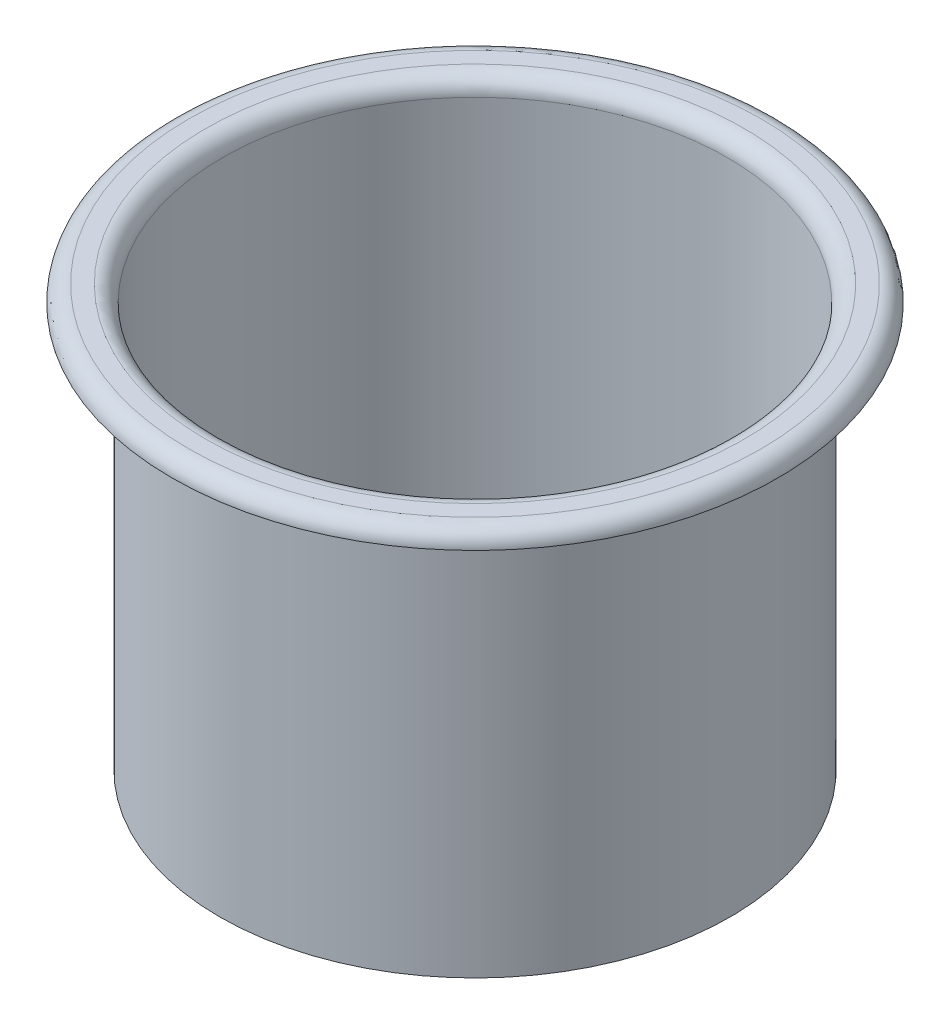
ISO-10303-21;
HEADER;
FILE_DESCRIPTION(('STEP AP214'),'2;1');
FILE_NAME('part.step','',(''),(''),'','','');
FILE_SCHEMA(('AUTOMOTIVE_DESIGN { 1 0 10303 214 1 1 1 1 }'));
ENDSEC;
DATA;
#1=APPLICATION_CONTEXT('core data for automotive mechanical design processes');
#2=APPLICATION_PROTOCOL_DEFINITION('international standard','automotive_design',2000,#1);
#3=PRODUCT_CONTEXT('',#1,'mechanical');
#4=PRODUCT('Part','Part','',(#3));
#5=PRODUCT_RELATED_PRODUCT_CATEGORY('part','',(#4));
#6=PRODUCT_DEFINITION_FORMATION('','',#4);
#7=PRODUCT_DEFINITION_CONTEXT('part definition',#1,'design');
#8=PRODUCT_DEFINITION('design','',#6,#7);
#9=PRODUCT_DEFINITION_SHAPE('','',#8);
#10=(LENGTH_UNIT() NAMED_UNIT(*) SI_UNIT(.MILLI.,.METRE.));
#11=(NAMED_UNIT(*) PLANE_ANGLE_UNIT() SI_UNIT($,.RADIAN.));
#12=(NAMED_UNIT(*) SI_UNIT($,.STERADIAN.) SOLID_ANGLE_UNIT());
#13=UNCERTAINTY_MEASURE_WITH_UNIT(LENGTH_MEASURE(1.E-05),#10,'distance_accuracy_value','');
#14=(GEOMETRIC_REPRESENTATION_CONTEXT(3) GLOBAL_UNCERTAINTY_ASSIGNED_CONTEXT((#13)) GLOBAL_UNIT_ASSIGNED_CONTEXT((#10,
#11,#12)) REPRESENTATION_CONTEXT('',''));
#15=CARTESIAN_POINT('',(0.,0.,0.));
#16=DIRECTION('',(0.,0.,1.));
#17=DIRECTION('',(1.,0.,0.));
#18=AXIS2_PLACEMENT_3D('',#15,#16,#17);
#19=CARTESIAN_POINT('',(0.,0.,0.));
#20=DIRECTION('',(0.,1.,0.));
#21=DIRECTION('',(0.,0.,1.));
#22=AXIS2_PLACEMENT_3D('',#19,#20,#21);
#23=TOROIDAL_SURFACE('',#22,85.,5.);
#24=CARTESIAN_POINT('',(0.,0.,0.));
#25=DIRECTION('',(0.,1.,0.));
#26=DIRECTION('',(0.,0.,1.));
#27=AXIS2_PLACEMENT_3D('',#24,#25,#26);
#28=CIRCLE('',#27,90.);
#29=CARTESIAN_POINT('',(0.,0.,90.));
#30=VERTEX_POINT('',#29);
#31=EDGE_CURVE('E10',#30,#30,#28,.T.);
#32=ORIENTED_EDGE('',*,*,#31,.T.);
#33=EDGE_LOOP('',(#32));
#34=FACE_BOUND('',#33,.T.);
#35=CARTESIAN_POINT('',(0.,5.,0.));
#36=DIRECTION('',(0.,1.,0.));
#37=DIRECTION('',(0.,0.,1.));
#38=AXIS2_PLACEMENT_3D('',#35,#36,#37);
#39=CIRCLE('',#38,85.);
#40=CARTESIAN_POINT('',(0.,5.,85.));
#41=VERTEX_POINT('',#40);
#42=EDGE_CURVE('E67',#41,#41,#39,.T.);
#43=ORIENTED_EDGE('',*,*,#42,.F.);
#44=EDGE_LOOP('',(#43));
#45=FACE_BOUND('',#44,.T.);
#46=ADVANCED_FACE('F33',(#34,#45),#23,.T.);
#47=CARTESIAN_POINT('',(90.,0.,0.));
#48=DIRECTION('',(0.,-1.,0.));
#49=DIRECTION('',(0.,0.,-1.));
#50=AXIS2_PLACEMENT_3D('',#47,#48,#49);
#51=PLANE('',#50);
#52=CARTESIAN_POINT('',(0.,0.,0.));
#53=DIRECTION('',(0.,1.,0.));
#54=DIRECTION('',(0.,0.,1.));
#55=AXIS2_PLACEMENT_3D('',#52,#53,#54);
#56=CIRCLE('',#55,89.1);
#57=CARTESIAN_POINT('',(0.,0.,89.1));
#58=VERTEX_POINT('',#57);
#59=EDGE_CURVE('E39',#58,#58,#56,.T.);
#60=ORIENTED_EDGE('',*,*,#59,.T.);
#61=EDGE_LOOP('',(#60));
#62=FACE_BOUND('',#61,.T.);
#63=ORIENTED_EDGE('',*,*,#31,.F.);
#64=EDGE_LOOP('',(#63));
#65=FACE_BOUND('',#64,.T.);
#66=ADVANCED_FACE('F75',(#62,#65),#51,.T.);
#67=CARTESIAN_POINT('',(0.,0.,0.));
#68=DIRECTION('',(0.,1.,0.));
#69=DIRECTION('',(0.,0.,1.));
#70=AXIS2_PLACEMENT_3D('',#67,#68,#69);
#71=TOROIDAL_SURFACE('',#70,85.,4.1);
#72=CARTESIAN_POINT('',(0.,4.10000000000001,0.));
#73=DIRECTION('',(0.,1.,0.));
#74=DIRECTION('',(0.,0.,1.));
#75=AXIS2_PLACEMENT_3D('',#72,#73,#74);
#76=CIRCLE('',#75,85.);
#77=CARTESIAN_POINT('',(0.,4.10000000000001,85.));
#78=VERTEX_POINT('',#77);
#79=EDGE_CURVE('E43',#78,#78,#76,.T.);
#80=ORIENTED_EDGE('',*,*,#79,.T.);
#81=EDGE_LOOP('',(#80));
#82=FACE_BOUND('',#81,.T.);
#83=ORIENTED_EDGE('',*,*,#59,.F.);
#84=EDGE_LOOP('',(#83));
#85=FACE_BOUND('',#84,.T.);
#86=ADVANCED_FACE('F79',(#82,#85),#71,.F.);
#87=CARTESIAN_POINT('',(85.,4.1,0.));
#88=DIRECTION('',(0.,-1.,0.));
#89=DIRECTION('',(0.,0.,-1.));
#90=AXIS2_PLACEMENT_3D('',#87,#88,#89);
#91=PLANE('',#90);
#92=CARTESIAN_POINT('',(0.,4.10000000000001,0.));
#93=DIRECTION('',(0.,1.,0.));
#94=DIRECTION('',(0.,0.,1.));
#95=AXIS2_PLACEMENT_3D('',#92,#93,#94);
#96=CIRCLE('',#95,80.);
#97=CARTESIAN_POINT('',(0.,4.10000000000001,80.));
#98=VERTEX_POINT('',#97);
#99=EDGE_CURVE('E47',#98,#98,#96,.T.);
#100=ORIENTED_EDGE('',*,*,#99,.T.);
#101=EDGE_LOOP('',(#100));
#102=FACE_BOUND('',#101,.T.);
#103=ORIENTED_EDGE('',*,*,#79,.F.);
#104=EDGE_LOOP('',(#103));
#105=FACE_BOUND('',#104,.T.);
#106=ADVANCED_FACE('F83',(#102,#105),#91,.T.);
#107=CARTESIAN_POINT('',(0.,0.,0.));
#108=DIRECTION('',(0.,1.,0.));
#109=DIRECTION('',(0.,0.,1.));
#110=AXIS2_PLACEMENT_3D('',#107,#108,#109);
#111=TOROIDAL_SURFACE('',#110,80.,4.1);
#112=CARTESIAN_POINT('',(0.,0.,0.));
#113=DIRECTION('',(0.,1.,0.));
#114=DIRECTION('',(0.,0.,1.));
#115=AXIS2_PLACEMENT_3D('',#112,#113,#114);
#116=CIRCLE('',#115,75.9);
#117=CARTESIAN_POINT('',(0.,0.,75.9));
#118=VERTEX_POINT('',#117);
#119=EDGE_CURVE('E52',#118,#118,#116,.T.);
#120=ORIENTED_EDGE('',*,*,#119,.T.);
#121=EDGE_LOOP('',(#120));
#122=FACE_BOUND('',#121,.T.);
#123=ORIENTED_EDGE('',*,*,#99,.F.);
#124=EDGE_LOOP('',(#123));
#125=FACE_BOUND('',#124,.T.);
#126=ADVANCED_FACE('F90',(#122,#125),#111,.F.);
#127=CARTESIAN_POINT('',(0.,-120.,0.));
#128=DIRECTION('',(0.,1.,0.));
#129=DIRECTION('',(0.,0.,1.));
#130=AXIS2_PLACEMENT_3D('',#127,#128,#129);
#131=CYLINDRICAL_SURFACE('',#130,75.9);
#132=CARTESIAN_POINT('',(0.,-120.,0.));
#133=DIRECTION('',(0.,1.,0.));
#134=DIRECTION('',(0.,0.,1.));
#135=AXIS2_PLACEMENT_3D('',#132,#133,#134);
#136=CIRCLE('',#135,75.9);
#137=CARTESIAN_POINT('',(0.,-120.,75.9));
#138=VERTEX_POINT('',#137);
#139=EDGE_CURVE('E55',#138,#138,#136,.T.);
#140=ORIENTED_EDGE('',*,*,#139,.T.);
#141=EDGE_LOOP('',(#140));
#142=FACE_BOUND('',#141,.T.);
#143=ORIENTED_EDGE('',*,*,#119,.F.);
#144=EDGE_LOOP('',(#143));
#145=FACE_BOUND('',#144,.T.);
#146=ADVANCED_FACE('F94',(#142,#145),#131,.T.);
#147=CARTESIAN_POINT('',(75.9,-120.,0.));
#148=DIRECTION('',(0.,-1.,0.));
#149=DIRECTION('',(0.,0.,-1.));
#150=AXIS2_PLACEMENT_3D('',#147,#148,#149);
#151=PLANE('',#150);
#152=CARTESIAN_POINT('',(0.,-120.,0.));
#153=DIRECTION('',(0.,1.,0.));
#154=DIRECTION('',(0.,0.,1.));
#155=AXIS2_PLACEMENT_3D('',#152,#153,#154);
#156=CIRCLE('',#155,75.);
#157=CARTESIAN_POINT('',(0.,-120.,75.));
#158=VERTEX_POINT('',#157);
#159=EDGE_CURVE('E58',#158,#158,#156,.T.);
#160=ORIENTED_EDGE('',*,*,#159,.T.);
#161=EDGE_LOOP('',(#160));
#162=FACE_BOUND('',#161,.T.);
#163=ORIENTED_EDGE('',*,*,#139,.F.);
#164=EDGE_LOOP('',(#163));
#165=FACE_BOUND('',#164,.T.);
#166=ADVANCED_FACE('F98',(#162,#165),#151,.T.);
#167=CARTESIAN_POINT('',(0.,-120.,0.));
#168=DIRECTION('',(0.,1.,0.));
#169=DIRECTION('',(0.,0.,1.));
#170=AXIS2_PLACEMENT_3D('',#167,#168,#169);
#171=CYLINDRICAL_SURFACE('',#170,75.);
#172=CARTESIAN_POINT('',(0.,0.,0.));
#173=DIRECTION('',(0.,1.,0.));
#174=DIRECTION('',(0.,0.,1.));
#175=AXIS2_PLACEMENT_3D('',#172,#173,#174);
#176=CIRCLE('',#175,75.);
#177=CARTESIAN_POINT('',(0.,0.,75.));
#178=VERTEX_POINT('',#177);
#179=EDGE_CURVE('E61',#178,#178,#176,.T.);
#180=ORIENTED_EDGE('',*,*,#179,.T.);
#181=EDGE_LOOP('',(#180));
#182=FACE_BOUND('',#181,.T.);
#183=ORIENTED_EDGE('',*,*,#159,.F.);
#184=EDGE_LOOP('',(#183));
#185=FACE_BOUND('',#184,.T.);
#186=ADVANCED_FACE('F102',(#182,#185),#171,.F.);
#187=CARTESIAN_POINT('',(0.,0.,0.));
#188=DIRECTION('',(0.,1.,0.));
#189=DIRECTION('',(0.,0.,1.));
#190=AXIS2_PLACEMENT_3D('',#187,#188,#189);
#191=TOROIDAL_SURFACE('',#190,80.,5.);
#192=CARTESIAN_POINT('',(0.,5.,0.));
#193=DIRECTION('',(0.,1.,0.));
#194=DIRECTION('',(0.,0.,1.));
#195=AXIS2_PLACEMENT_3D('',#192,#193,#194);
#196=CIRCLE('',#195,80.);
#197=CARTESIAN_POINT('',(0.,5.,80.));
#198=VERTEX_POINT('',#197);
#199=EDGE_CURVE('E64',#198,#198,#196,.T.);
#200=ORIENTED_EDGE('',*,*,#199,.T.);
#201=EDGE_LOOP('',(#200));
#202=FACE_BOUND('',#201,.T.);
#203=ORIENTED_EDGE('',*,*,#179,.F.);
#204=EDGE_LOOP('',(#203));
#205=FACE_BOUND('',#204,.T.);
#206=ADVANCED_FACE('F106',(#202,#205),#191,.T.);
#207=CARTESIAN_POINT('',(80.,5.,0.));
#208=DIRECTION('',(0.,1.,0.));
#209=DIRECTION('',(0.,0.,1.));
#210=AXIS2_PLACEMENT_3D('',#207,#208,#209);
#211=PLANE('',#210);
#212=ORIENTED_EDGE('',*,*,#42,.T.);
#213=EDGE_LOOP('',(#212));
#214=FACE_BOUND('',#213,.T.);
#215=ORIENTED_EDGE('',*,*,#199,.F.);
#216=EDGE_LOOP('',(#215));
#217=FACE_BOUND('',#216,.T.);
#218=ADVANCED_FACE('F71',(#214,#217),#211,.T.);
#219=CLOSED_SHELL('',(#46,#66,#86,#106,#126,#146,#166,#186,#206,#218));
#220=MANIFOLD_SOLID_BREP('B2',#219);
#221=ADVANCED_BREP_SHAPE_REPRESENTATION('',(#18,#220),#14);
#222=SHAPE_DEFINITION_REPRESENTATION(#9,#221);
ENDSEC;
END-ISO-10303-21;
